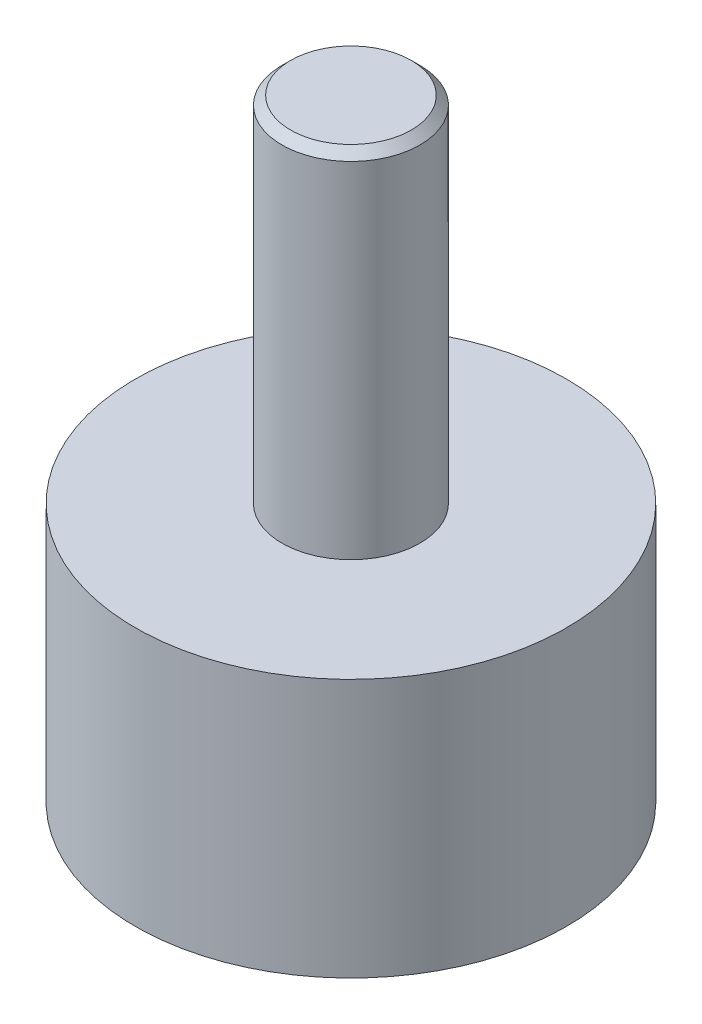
from build123d import *


with BuildPart() as part:
    # Esquisse1 → Base-R_volution (revolve)
    with BuildSketch(Plane.XY, mode=Mode.PRIVATE) as base_r_volution_sk:
        Polygon((0, 0), (-12.5, 0), (-12.5, 15), (-4, 15), (-4, 35), (-3.5, 35.5), (0, 35.5), align=None)
    revolve(base_r_volution_sk.sketch.rotate(Axis((0, 0, 0), (0, 1, 0)), 270), axis=Axis((0, 0, 0), (0, 1, 0)))


solid = part.part
